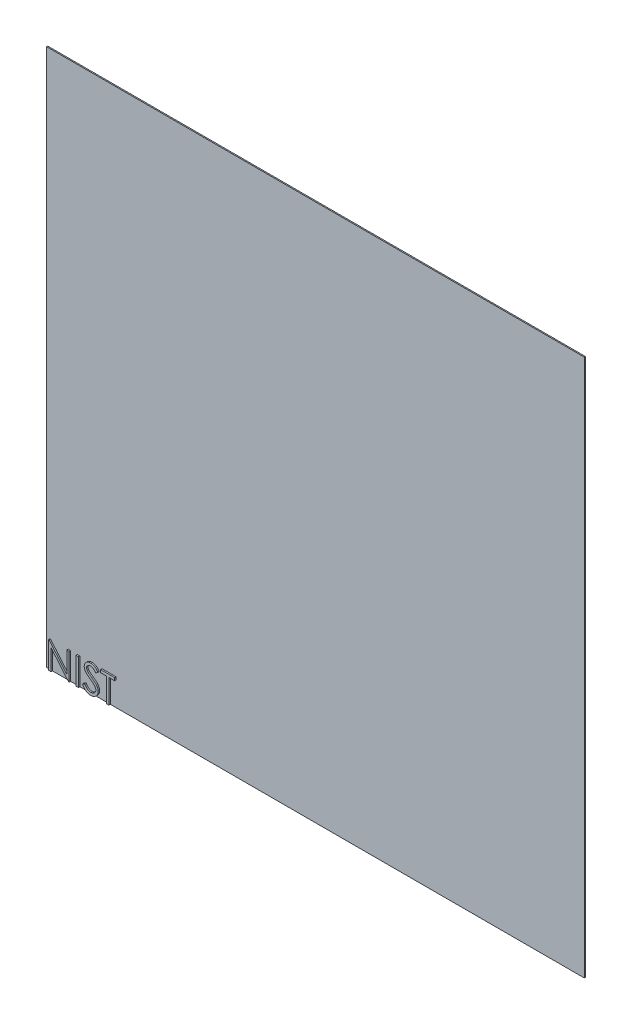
from build123d import *

# Parameters (mm, degrees)
SKETCH1_W           = 383.54
SKETCH1_H           = 383.54
BOSS_EXTRUDE1_DEPTH = 0.79375
SKETCH2_W           = 1.709615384
SKETCH2_H           = 19.05
BOSS_EXTRUDE2_DEPTH = 1


with BuildPart() as part:
    # Sketch1 → Boss-Extrude1 (new body)
    with BuildSketch(Plane.XY):
        with Locations((191.77, 191.77)):
            Rectangle(SKETCH1_W, SKETCH1_H)
    extrude(amount=BOSS_EXTRUDE1_DEPTH)

    # Sketch2 → Boss-Extrude2 (add)
    with BuildSketch(Plane.XY.offset(0.79375)):
        Polygon((2.442307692, 0), (2.442307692, 19.05), (2.801021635, 19.05), (15.386538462, 4.056520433), (15.386538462, 19.05), (17.096153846, 19.05), (17.096153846, 0), (16.706911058, 0), (4.151923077, 14.959134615), (4.151923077, 0), align=None)
        with Locations((22.835576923, 9.525)):
            Rectangle(SKETCH2_W, SKETCH2_H)
        with BuildLine():
            Line((26.621153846, 3.674909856), (28.231550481, 4.640384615))
            add(Edge.make_bspline(
                [(28.231550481, 4.640384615), (28.381328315, 4.389662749), (28.668296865, 3.909289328), (29.147003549, 3.260184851), (29.643026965, 2.708485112), (30.160040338, 2.257399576), (30.694887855, 1.902259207), (31.251061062, 1.65078706), (31.826685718, 1.493945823), (32.218428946, 1.474895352), (32.414002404, 1.465384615)],
                knots=[0, 0, 0, 0, 1.272034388, 2.437168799, 3.508375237, 4.49857839, 5.41946034, 6.295179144, 7.148887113, 8, 8, 8, 8], degree=3))
            add(Edge.make_bspline(
                [(32.414002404, 1.465384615), (32.581026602, 1.470036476), (32.912152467, 1.4792588), (33.39962696, 1.56787288), (33.873056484, 1.704010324), (34.322683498, 1.898978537), (34.742303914, 2.134863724), (35.110277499, 2.41977649), (35.428391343, 2.738761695), (35.688609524, 3.094630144), (35.888253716, 3.477356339), (36.041699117, 3.870199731), (36.126853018, 4.27933151), (36.13968049, 4.554797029), (36.146153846, 4.693810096)],
                knots=[0, 0, 0, 0, 1.095163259, 2.171163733, 3.241058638, 4.321873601, 5.38011039, 6.391990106, 7.366004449, 8.327778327, 9.272591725, 10.192022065, 11.087607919, 12, 12, 12, 12], degree=3))
            add(Edge.make_bspline(
                [(36.146153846, 4.693810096), (36.138129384, 4.852419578), (36.121816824, 5.174849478), (35.983941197, 5.650553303), (35.767047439, 6.121320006), (35.566953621, 6.412519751), (35.463070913, 6.563701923)],
                knots=[0, 0, 0, 0, 0.938893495, 1.908633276, 2.914225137, 4, 4, 4, 4], degree=3))
            add(Edge.make_bspline(
                [(35.463070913, 6.563701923), (35.377777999, 6.67281392), (35.198716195, 6.901880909), (34.890881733, 7.242849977), (34.529660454, 7.5945588), (34.127413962, 7.970437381), (33.669489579, 8.353003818), (33.170229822, 8.760501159), (32.616887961, 9.1774326), (32.228814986, 9.457046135), (32.028575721, 9.601322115)],
                knots=[0, 0, 0, 0, 0.722233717, 1.516239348, 2.393582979, 3.351407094, 4.387010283, 5.505090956, 6.712668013, 8, 8, 8, 8], degree=3))
            add(Edge.make_bspline(
                [(32.028575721, 9.601322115), (31.828147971, 9.744080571), (31.444945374, 10.017023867), (30.909049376, 10.422104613), (30.429835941, 10.792457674), (30.009435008, 11.131569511), (29.648031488, 11.439486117), (29.342777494, 11.713250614), (29.101449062, 11.960266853), (28.967252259, 12.12051187), (28.907001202, 12.192457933)],
                knots=[0, 0, 0, 0, 1.452282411, 2.77665338, 3.964542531, 5.026858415, 5.96415736, 6.766646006, 7.446254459, 8, 8, 8, 8], degree=3))
            add(Edge.make_bspline(
                [(28.907001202, 12.192457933), (28.822786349, 12.304586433), (28.657166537, 12.525102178), (28.438548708, 12.869770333), (28.252734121, 13.222594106), (28.107070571, 13.584521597), (27.984409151, 13.95047171), (27.9019067, 14.325219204), (27.850246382, 14.707082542), (27.844955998, 14.964058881), (27.842307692, 15.092698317)],
                knots=[0, 0, 0, 0, 1.068054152, 2.10047183, 3.106115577, 4.101338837, 5.06977816, 6.043150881, 7.020423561, 8, 8, 8, 8], degree=3))
            add(Edge.make_bspline(
                [(27.842307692, 15.092698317), (27.849411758, 15.29424609), (27.863468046, 15.693033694), (27.982342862, 16.275587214), (28.169973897, 16.831773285), (28.432836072, 17.35608553), (28.77169395, 17.834871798), (29.163829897, 18.273639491), (29.630889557, 18.642494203), (30.143348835, 18.964776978), (30.704269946, 19.217031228), (31.292049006, 19.407318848), (31.907620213, 19.515137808), (32.324560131, 19.530610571), (32.536117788, 19.538461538)],
                knots=[0, 0, 0, 0, 1.005424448, 1.989358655, 2.955360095, 3.929531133, 4.905563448, 5.876582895, 6.856512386, 7.866279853, 8.892233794, 9.918561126, 10.94386622, 12, 12, 12, 12], degree=3))
            add(Edge.make_bspline(
                [(32.536117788, 19.538461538), (32.760603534, 19.530718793), (33.207034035, 19.515320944), (33.863710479, 19.381440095), (34.495956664, 19.159912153), (35.004555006, 18.908513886), (35.402606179, 18.657427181), (35.706169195, 18.42871928), (36.013785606, 18.165420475), (36.327936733, 17.866829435), (36.643299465, 17.530206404), (36.964555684, 17.157856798), (37.292456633, 16.752056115), (37.503399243, 16.462362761), (37.611538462, 16.313852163)],
                knots=[0, 0, 0, 0, 1.286793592, 2.559021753, 3.825965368, 5.121522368, 5.803751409, 6.523245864, 7.299691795, 8.125521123, 9.008227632, 9.944561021, 10.946284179, 12, 12, 12, 12], degree=3))
            Line((37.611538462, 16.313852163), (36.066015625, 15.142307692))
            add(Edge.make_bspline(
                [(36.066015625, 15.142307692), (35.972692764, 15.262533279), (35.792974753, 15.494059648), (35.520127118, 15.818297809), (35.262959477, 16.114478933), (35.009592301, 16.371736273), (34.773406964, 16.604157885), (34.54416992, 16.803147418), (34.325180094, 16.970654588), (34.049135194, 17.149417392), (33.702328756, 17.32661779), (33.266984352, 17.476563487), (32.812036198, 17.566670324), (32.502176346, 17.578584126), (32.3453125, 17.584615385)],
                knots=[0, 0, 0, 0, 1.181633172, 2.275549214, 3.290209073, 4.226197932, 5.078386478, 5.862611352, 6.581680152, 7.217281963, 8.414376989, 9.595101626, 10.782541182, 12, 12, 12, 12], degree=3))
            add(Edge.make_bspline(
                [(32.3453125, 17.584615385), (32.148517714, 17.578020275), (31.769017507, 17.565302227), (31.230227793, 17.426400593), (30.745302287, 17.207696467), (30.328637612, 16.901182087), (29.981726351, 16.538029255), (29.730780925, 16.120132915), (29.579740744, 15.65867441), (29.561309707, 15.336774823), (29.551923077, 15.172836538)],
                knots=[0, 0, 0, 0, 1.14458467, 2.207223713, 3.21896685, 4.227309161, 5.202851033, 6.127160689, 7.046193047, 8, 8, 8, 8], degree=3))
            add(Edge.make_bspline(
                [(29.551923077, 15.172836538), (29.554062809, 15.07077492), (29.558345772, 14.866484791), (29.618080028, 14.564670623), (29.694820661, 14.263618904), (29.816428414, 13.964683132), (29.984314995, 13.662635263), (30.204778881, 13.352274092), (30.482437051, 13.030864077), (30.695127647, 12.821818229), (30.807421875, 12.711448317)],
                knots=[0, 0, 0, 0, 0.858281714, 1.717966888, 2.583508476, 3.4729293, 4.427298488, 5.488583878, 6.674047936, 8, 8, 8, 8], degree=3))
            add(Edge.make_bspline(
                [(30.807421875, 12.711448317), (30.849121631, 12.674235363), (30.948190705, 12.5858259), (31.129306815, 12.441087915), (31.368481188, 12.262547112), (31.659468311, 12.041636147), (32.007633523, 11.785378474), (32.413015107, 11.497050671), (32.871094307, 11.167292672), (33.196152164, 10.93674663), (33.368028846, 10.81484375)],
                knots=[0, 0, 0, 0, 0.420754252, 0.999615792, 1.744751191, 2.668019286, 3.750313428, 4.999500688, 6.413464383, 8, 8, 8, 8], degree=3))
            add(Edge.make_bspline(
                [(33.368028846, 10.81484375), (33.574780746, 10.664395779), (33.975127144, 10.373074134), (34.5447634, 9.935383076), (35.061256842, 9.507314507), (35.52642085, 9.091602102), (35.94485088, 8.691399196), (36.311904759, 8.301891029), (36.631322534, 7.925868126), (36.975197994, 7.44378025), (37.326576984, 6.851700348), (37.628337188, 6.126285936), (37.818610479, 5.398051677), (37.843492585, 4.908592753), (37.855769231, 4.667097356)],
                knots=[0, 0, 0, 0, 1.163667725, 2.253281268, 3.268753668, 4.215851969, 5.092017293, 5.902905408, 6.650798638, 7.335211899, 8.59617414, 9.77448103, 10.901945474, 12, 12, 12, 12], degree=3))
            add(Edge.make_bspline(
                [(37.855769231, 4.667097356), (37.852192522, 4.496309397), (37.845108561, 4.158050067), (37.763678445, 3.66136172), (37.644372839, 3.178956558), (37.464555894, 2.716797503), (37.245082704, 2.26642958), (36.966592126, 1.839666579), (36.643788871, 1.427063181), (36.273490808, 1.039621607), (35.868292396, 0.683951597), (35.440028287, 0.36756342), (34.987997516, 0.10375726), (34.514652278, -0.111512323), (34.019883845, -0.27987904), (33.503858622, -0.401869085), (32.965725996, -0.476739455), (32.599963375, -0.484510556), (32.414002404, -0.488461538)],
                knots=[0, 0, 0, 0, 0.983748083, 1.948392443, 2.894712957, 3.844097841, 4.80183111, 5.778335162, 6.776009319, 7.81870978, 8.863265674, 9.881300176, 10.883814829, 11.87499822, 12.874611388, 13.892143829, 14.928324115, 16, 16, 16, 16], degree=3))
            add(Edge.make_bspline(
                [(32.414002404, -0.488461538), (32.270118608, -0.48567925), (31.984163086, -0.480149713), (31.561201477, -0.431265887), (31.14678457, -0.362102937), (30.74611255, -0.252298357), (30.354023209, -0.119073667), (29.972221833, 0.044964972), (29.600523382, 0.241545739), (29.236844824, 0.466308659), (28.882111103, 0.727880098), (28.539649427, 1.032535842), (28.198223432, 1.37187352), (27.867910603, 1.755108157), (27.542029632, 2.176048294), (27.227005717, 2.638632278), (26.916318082, 3.140340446), (26.721379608, 3.493391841), (26.621153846, 3.674909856)],
                knots=[0, 0, 0, 0, 0.915332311, 1.819136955, 2.706846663, 3.586547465, 4.459518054, 5.340707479, 6.227863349, 7.133153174, 8.059268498, 9.028702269, 10.047606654, 11.120612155, 12.245963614, 13.433783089, 14.680604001, 16, 16, 16, 16], degree=3))
        make_face()
        Polygon((39.565384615, 17.096153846), (39.565384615, 19.05), (49.578846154, 19.05), (49.578846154, 17.096153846), (45.426923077, 17.096153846), (45.426923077, 0), (43.717307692, 0), (43.717307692, 17.096153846), align=None)
    extrude(amount=BOSS_EXTRUDE2_DEPTH)


solid = part.part
